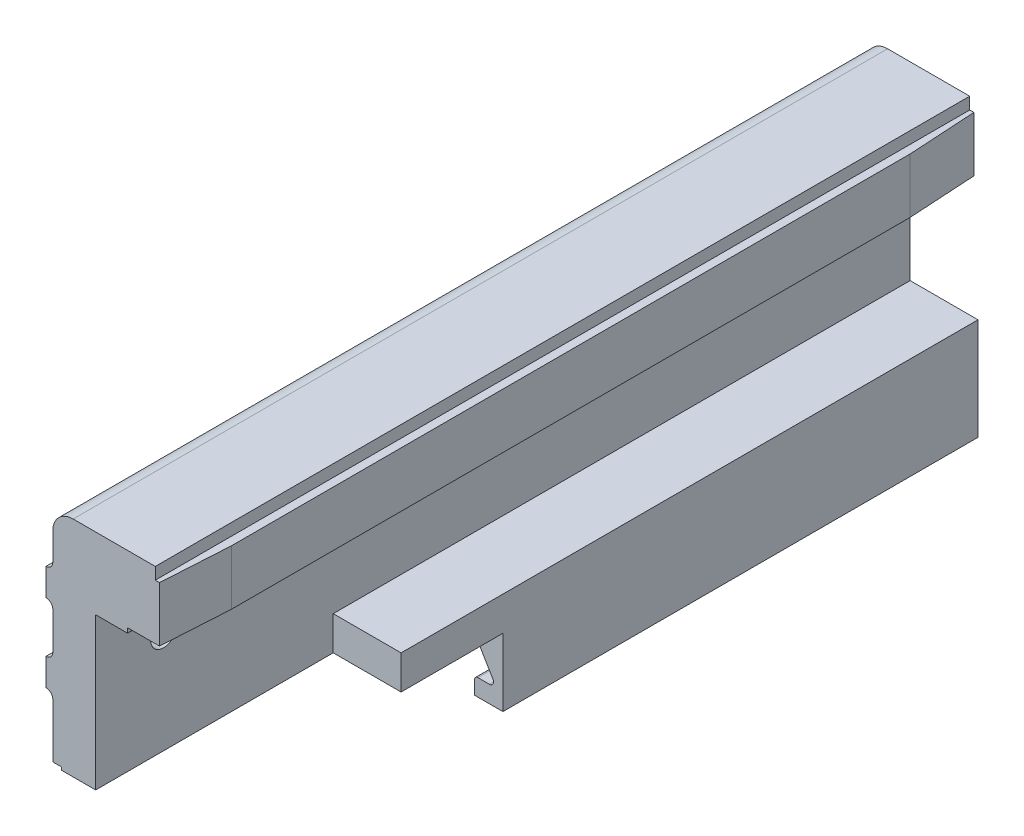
from build123d import *

# Parameters (mm, degrees)
EXTRUDE1_DEPTH     = 152.4
SKETCH2_W          = 63.5
SKETCH2_H          = 12.7
CUT_EXTRUDE1_DEPTH = 164.342499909
SKETCH3_W          = 44.45
SKETCH3_H          = 6.35
CUT_EXTRUDE2_DEPTH = 12.7
SKETCH4_R          = 2.413
CUT_EXTRUDE3_DEPTH = 163.352134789
CUT_EXTRUDE4_REACH = 164.539
SKETCH10_W         = 0.790251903
SKETCH10_H         = 0.684884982
SKETCH10_H_2       = 3.002957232
EXTRUDE3_DEPTH     = 0.127


with BuildPart() as part:
    # Sketch1 → Extrude1 (new body)
    with BuildSketch(Plane.XY):
        with BuildLine():
            Line((19.91614, 54.5084), (4.546619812, 54.5084))
            ThreePointArc((4.546619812, 54.5084), (1.852528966, 53.392471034), (0.7366, 50.698380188))
            Line((0.7366, 50.698380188), (0.7366, 45.567713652))
            ThreePointArc((0.7366, 45.567713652), (0.364632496, 44.669647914), (-0.5334, 44.297600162))
            Line((-0.5334, 44.297600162), (-0.5334, 39.217600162))
            ThreePointArc((-0.5334, 39.217600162), (0.358682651, 38.85157562), (0.7366, 37.964465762))
            Line((0.7366, 37.964465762), (0.7366, 30.988190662))
            ThreePointArc((0.7366, 30.988190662), (0.36459237, 30.090084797), (-0.533513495, 29.718077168))
            Line((-0.533513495, 29.718077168), (-0.533513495, 24.638077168))
            ThreePointArc((-0.533513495, 24.638077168), (0.36459237, 24.266069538), (0.7366, 23.367963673))
            Line((0.7366, 23.367963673), (0.7366, 13.235253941))
            Line((0.7366, 13.235253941), (2.413, 13.235253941))
            Line((2.413, 13.235253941), (2.413, 10.822253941))
            ThreePointArc((2.413, 10.822253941), (2.355993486, 10.533068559), (2.193503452, 10.287152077))
            Line((2.193503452, 10.287152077), (0.219496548, 8.28584049))
            ThreePointArc((0.219496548, 8.28584049), (0.057006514, 8.039924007), (0, 7.750738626))
            Line((0, 7.750738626), (0, 0))
            Line((0, 0), (7.7216, 0))
            Line((7.7216, 0), (7.7216, 2.54))
            ThreePointArc((7.7216, 2.54), (7.535612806, 2.989012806), (7.0866, 3.175))
            Line((7.0866, 3.175), (2.667, 3.175))
            ThreePointArc((2.667, 3.175), (1.964009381, 3.642979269), (2.124496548, 4.472101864))
            Line((2.124496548, 4.472101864), (8.414593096, 10.849203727))
            ThreePointArc((8.414593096, 10.849203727), (8.911558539, 11.184981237), (9.4996, 11.303))
            Line((9.4996, 11.303), (14.5796, 11.303))
            ThreePointArc((14.5796, 11.303), (15.332434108, 11.104072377), (15.88873344, 10.559221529))
            Line((15.88873344, 10.559221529), (19.60296672, 4.327110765))
            ThreePointArc((19.60296672, 4.327110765), (19.610936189, 3.560582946), (18.9484, 3.175))
            Line((18.9484, 3.175), (16.7894, 3.175))
            ThreePointArc((16.7894, 3.175), (16.340387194, 2.989012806), (16.1544, 2.54))
            Line((16.1544, 2.54), (16.1544, 0))
            Line((16.1544, 0), (21.463, 0))
            Line((21.463, 0), (21.463, 19.05))
            Line((21.463, 19.05), (8.763, 19.05))
            Line((8.763, 19.05), (8.763, 41.0972))
            Line((8.763, 41.0972), (14.732, 41.0972))
            Line((14.732, 41.0972), (14.732, 41.9862))
            Line((14.732, 41.9862), (21.463, 41.9862))
            Line((21.463, 41.9862), (21.463, 52.2732))
            Line((21.463, 52.2732), (19.91614, 52.2732))
            Line((19.91614, 52.2732), (19.91614, 54.5084))
        make_face()
    extrude(amount=-EXTRUDE1_DEPTH)

    # Sketch2 → Cut-Extrude1 (cut, through all)
    with BuildSketch(Plane(origin=(21.463, 0, 0), x_dir=(0, 0, -1), z_dir=(1, 0, 0))):
        with Locations((31.75, 6.35)):
            Rectangle(SKETCH2_W, SKETCH2_H)
    extrude(amount=-CUT_EXTRUDE1_DEPTH, mode=Mode.SUBTRACT)

    # Sketch3 → Cut-Extrude2 (cut)
    with BuildSketch(Plane(origin=(21.463, 0, 0), x_dir=(0, 0, -1), z_dir=(1, 0, 0))):
        with Locations((22.225, 15.875)):
            Rectangle(SKETCH3_W, SKETCH3_H)
    extrude(amount=-CUT_EXTRUDE2_DEPTH, mode=Mode.SUBTRACT)

    # Sketch4 → Cut-Extrude3 (cut, through all)
    with BuildSketch(Plane(origin=(8.763, 0, 0), x_dir=(0, 0, -1), z_dir=(1, 0, 0))):
        with Locations((12.7, 31.8008)):
            Circle(SKETCH4_R)
        with Locations((139.7, 31.8008)):
            Circle(SKETCH4_R)
    extrude(amount=-CUT_EXTRUDE3_DEPTH, mode=Mode.SUBTRACT)

    # Sketch6 → Cut-Extrude4 (cut, up to next)
    with BuildSketch(Plane(origin=(0, 52.2732, 0), x_dir=(-1, 0, 0), z_dir=(0, 1, 0)), mode=Mode.PRIVATE) as cut_extrude4_sk1:
        Polygon((-21.463, -152.4), (-21.463, -139.7), (-20.701, -152.4), align=None)
    cut_extrude4_tool1 = extrude(cut_extrude4_sk1.sketch, amount=-CUT_EXTRUDE4_REACH, mode=Mode.PRIVATE) & part.part
    # Sketch6 → Cut-Extrude4 (cut, up to next)
    with BuildSketch(Plane(origin=(0, 52.2732, 0), x_dir=(-1, 0, 0), z_dir=(0, 1, 0)), mode=Mode.PRIVATE) as cut_extrude4_sk2:
        Polygon((-21.463, 0), (-21.463, -12.7), (-20.701, 0), align=None)
    cut_extrude4_tool2 = extrude(cut_extrude4_sk2.sketch, amount=-CUT_EXTRUDE4_REACH, mode=Mode.PRIVATE) & part.part
    add(cut_extrude4_tool1.solids().sort_by_distance((21.209, 52.2732, -148.166667))[0], mode=Mode.SUBTRACT)
    add(cut_extrude4_tool2.solids().sort_by_distance((21.209, 52.2732, -4.233333))[0], mode=Mode.SUBTRACT)

    # Sketch10 → Extrude3 (add)
    # profile 1 of 10: a face of its own
    with BuildSketch(Plane.ZY.offset(-0.7366)):
        with BuildLine():
            add(Edge.make_bspline(
                [(-50.311029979, 33.066190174), (-50.260220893, 33.031363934), (-50.158405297, 32.961576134), (-49.996458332, 32.871296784), (-49.829363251, 32.789223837), (-49.713236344, 32.745079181), (-49.654956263, 32.722924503)],
                knots=[0, 0, 0, 0, 0.994855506, 1.99357661, 2.993045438, 4, 4, 4, 4], degree=3))
            Line((-49.654956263, 32.722924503), (-49.95706298, 32.143406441))
            add(Edge.make_bspline(
                [(-49.95706298, 32.143406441), (-50.018825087, 32.162524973), (-50.143331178, 32.201065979), (-50.260858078, 32.257418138), (-50.320084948, 32.285816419)],
                knots=[0, 0, 0, 0, 0.992113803, 2, 2, 2, 2], degree=3))
            add(Edge.make_bspline(
                [(-50.320084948, 32.285816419), (-50.32589684, 32.288748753), (-50.342727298, 32.297240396), (-50.373297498, 32.318144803), (-50.419940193, 32.346320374), (-50.480656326, 32.385347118), (-50.556056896, 32.433720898), (-50.646385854, 32.491389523), (-50.750397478, 32.559983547), (-50.825198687, 32.60829556), (-50.86502949, 32.634021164)],
                knots=[0, 0, 0, 0, 0.241377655, 0.698997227, 1.371388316, 2.263975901, 3.376788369, 4.695767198, 6.240533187, 8, 8, 8, 8], degree=3))
            add(Edge.make_bspline(
                [(-50.86502949, 32.634021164), (-50.898062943, 32.619874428), (-50.964449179, 32.591444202), (-51.067450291, 32.556436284), (-51.17307066, 32.526945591), (-51.280935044, 32.501935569), (-51.391499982, 32.483352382), (-51.50460917, 32.469101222), (-51.620579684, 32.460743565), (-51.698896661, 32.459921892), (-51.738422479, 32.459507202)],
                knots=[0, 0, 0, 0, 0.961025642, 1.931341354, 2.907359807, 3.893838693, 4.891829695, 5.905170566, 6.942759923, 8, 8, 8, 8], degree=3))
            add(Edge.make_bspline(
                [(-51.738422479, 32.459507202), (-51.813397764, 32.461332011), (-51.95995306, 32.464898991), (-52.173649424, 32.490179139), (-52.374443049, 32.533996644), (-52.563215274, 32.593847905), (-52.738831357, 32.672417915), (-52.902831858, 32.76739109), (-53.052946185, 32.881231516), (-53.191242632, 33.010450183), (-53.313595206, 33.156501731), (-53.420706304, 33.316836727), (-53.511443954, 33.490923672), (-53.584609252, 33.679679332), (-53.642433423, 33.881577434), (-53.681857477, 34.09804325), (-53.707231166, 34.327792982), (-53.710107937, 34.485829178), (-53.711582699, 34.56684561)],
                knots=[0, 0, 0, 0, 1.098101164, 2.146474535, 3.146072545, 4.104420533, 5.041773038, 5.958565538, 6.874115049, 7.795336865, 8.725215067, 9.658214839, 10.614563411, 11.594512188, 12.618591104, 13.685899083, 14.813688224, 16, 16, 16, 16], degree=3))
            add(Edge.make_bspline(
                [(-53.711582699, 34.56684561), (-53.710104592, 34.647858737), (-53.707231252, 34.805342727), (-53.682030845, 35.034649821), (-53.641292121, 35.25034225), (-53.584057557, 35.452561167), (-53.509796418, 35.640775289), (-53.418704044, 35.814879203), (-53.31142455, 35.975552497), (-53.187621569, 36.121282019), (-53.050058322, 36.251823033), (-52.899507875, 36.364817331), (-52.737720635, 36.461292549), (-52.564053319, 36.539788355), (-52.37802651, 36.599606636), (-52.181056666, 36.643284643), (-51.972053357, 36.668873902), (-51.829043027, 36.672384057), (-51.755709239, 36.674184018)],
                knots=[0, 0, 0, 0, 1.193283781, 2.319662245, 3.393996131, 4.424093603, 5.411284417, 6.369670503, 7.313761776, 8.251713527, 9.181123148, 10.102053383, 11.01932051, 11.951118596, 12.903560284, 13.893239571, 14.919681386, 16, 16, 16, 16], degree=3))
            add(Edge.make_bspline(
                [(-51.755709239, 36.674184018), (-51.68290217, 36.67286055), (-51.540898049, 36.670279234), (-51.333836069, 36.642671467), (-51.138180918, 36.600783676), (-50.953699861, 36.540402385), (-50.781338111, 36.461986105), (-50.620198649, 36.366778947), (-50.471221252, 36.253976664), (-50.334363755, 36.124681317), (-50.2119586, 35.979454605), (-50.103524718, 35.820685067), (-50.014498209, 35.646415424), (-49.939498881, 35.459602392), (-49.883590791, 35.258423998), (-49.842319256, 35.044033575), (-49.817468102, 34.815755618), (-49.814518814, 34.658829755), (-49.813006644, 34.578370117)],
                knots=[0, 0, 0, 0, 1.078752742, 2.104017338, 3.091035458, 4.041673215, 4.975566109, 5.892967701, 6.810684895, 7.740128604, 8.678185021, 9.621404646, 10.583875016, 11.573429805, 12.6009998, 13.674031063, 14.80742018, 16, 16, 16, 16], degree=3))
            add(Edge.make_bspline(
                [(-49.813006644, 34.578370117), (-49.814637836, 34.493501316), (-49.817808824, 34.328518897), (-49.84540579, 34.08892719), (-49.890141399, 33.864544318), (-49.936229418, 33.723539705), (-49.958709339, 33.654763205)],
                knots=[0, 0, 0, 0, 1.083667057, 2.106616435, 3.076482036, 4, 4, 4, 4], degree=3))
            add(Edge.make_bspline(
                [(-49.958709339, 33.654763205), (-49.978860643, 33.604103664), (-50.019854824, 33.501045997), (-50.100885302, 33.352288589), (-50.197295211, 33.205527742), (-50.272580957, 33.113294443), (-50.311029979, 33.066190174)],
                knots=[0, 0, 0, 0, 0.948216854, 1.928975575, 2.942311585, 4, 4, 4, 4], degree=3))
        make_face()
        with BuildLine():
            add(Edge.make_bspline(
                [(-50.97039641, 33.489304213), (-50.940684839, 33.521786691), (-50.881190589, 33.586829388), (-50.807620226, 33.698235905), (-50.743387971, 33.817706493), (-50.692887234, 33.948221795), (-50.652271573, 34.087794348), (-50.623925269, 34.237461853), (-50.606320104, 34.396848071), (-50.604297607, 34.506431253), (-50.603258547, 34.562729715)],
                knots=[0, 0, 0, 0, 0.906820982, 1.815812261, 2.745108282, 3.70056618, 4.696560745, 5.740060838, 6.83895416, 8, 8, 8, 8], degree=3))
            add(Edge.make_bspline(
                [(-50.603258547, 34.562729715), (-50.604169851, 34.620655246), (-50.605935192, 34.732866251), (-50.620557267, 34.895812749), (-50.646288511, 35.04727694), (-50.679870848, 35.187890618), (-50.7256262, 35.316515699), (-50.780806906, 35.434121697), (-50.845499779, 35.54099798), (-50.921294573, 35.635381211), (-51.004661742, 35.718357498), (-51.093780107, 35.791658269), (-51.189951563, 35.853015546), (-51.292686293, 35.902373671), (-51.40112458, 35.941211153), (-51.515523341, 35.969406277), (-51.636140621, 35.985905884), (-51.718615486, 35.988153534), (-51.760648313, 35.989299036)],
                knots=[0, 0, 0, 0, 1.335693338, 2.587451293, 3.768164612, 4.876224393, 5.916940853, 6.910477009, 7.867661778, 8.790666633, 9.694493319, 10.576027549, 11.446684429, 12.318352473, 13.199023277, 14.098364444, 15.030842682, 16, 16, 16, 16], degree=3))
            add(Edge.make_bspline(
                [(-51.760648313, 35.989299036), (-51.80296255, 35.988190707), (-51.885725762, 35.986022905), (-52.006461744, 35.969123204), (-52.121121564, 35.942286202), (-52.229424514, 35.90314192), (-52.3323497, 35.85369016), (-52.428880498, 35.792446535), (-52.519003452, 35.720296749), (-52.602790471, 35.637844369), (-52.677624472, 35.543431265), (-52.744145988, 35.438415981), (-52.799138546, 35.321589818), (-52.84329949, 35.193608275), (-52.878591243, 35.05512905), (-52.904005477, 34.905409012), (-52.918646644, 34.744673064), (-52.920418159, 34.633828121), (-52.921330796, 34.576723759)],
                knots=[0, 0, 0, 0, 0.980107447, 1.917010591, 2.819119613, 3.703969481, 4.579773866, 5.459928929, 6.346604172, 7.250235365, 8.177620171, 9.131899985, 10.124404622, 11.161948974, 12.264485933, 13.431998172, 14.677033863, 16, 16, 16, 16], degree=3))
            add(Edge.make_bspline(
                [(-52.921330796, 34.576723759), (-52.92044062, 34.518793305), (-52.918712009, 34.406299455), (-52.903752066, 34.24319346), (-52.87949925, 34.091227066), (-52.844974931, 33.950463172), (-52.80083418, 33.820740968), (-52.746464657, 33.702241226), (-52.682154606, 33.59511213), (-52.607697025, 33.500325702), (-52.525786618, 33.416936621), (-52.43826186, 33.344239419), (-52.345833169, 33.281964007), (-52.248069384, 33.231365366), (-52.144944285, 33.192507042), (-52.036817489, 33.164462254), (-51.923059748, 33.147746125), (-51.845491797, 33.145525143), (-51.805923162, 33.144392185)],
                knots=[0, 0, 0, 0, 1.356840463, 2.634818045, 3.833173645, 4.958776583, 6.025986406, 7.038359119, 8.007356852, 8.946032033, 9.855123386, 10.740685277, 11.607120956, 12.460971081, 13.313368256, 14.183325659, 15.073285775, 16, 16, 16, 16], degree=3))
            add(Edge.make_bspline(
                [(-51.805923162, 33.144392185), (-51.776248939, 33.144912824), (-51.71779689, 33.145938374), (-51.631440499, 33.157466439), (-51.547320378, 33.174131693), (-51.492988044, 33.191100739), (-51.465950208, 33.199545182)],
                knots=[0, 0, 0, 0, 1.028828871, 2.026578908, 3.017950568, 4, 4, 4, 4], degree=3))
            add(Edge.make_bspline(
                [(-51.465950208, 33.199545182), (-51.507402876, 33.221204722), (-51.589489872, 33.264096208), (-51.716400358, 33.31874778), (-51.843564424, 33.367987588), (-51.930051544, 33.394590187), (-51.973028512, 33.407809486)],
                knots=[0, 0, 0, 0, 1.021704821, 2.023239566, 3.017713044, 4, 4, 4, 4], degree=3))
            Line((-51.973028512, 33.407809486), (-51.743361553, 33.881960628))
            add(Edge.make_bspline(
                [(-51.743361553, 33.881960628), (-51.676198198, 33.858750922), (-51.541223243, 33.812107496), (-51.346245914, 33.71948968), (-51.153985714, 33.614077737), (-51.032053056, 33.531208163), (-50.97039641, 33.489304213)],
                knots=[0, 0, 0, 0, 0.979271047, 1.967993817, 2.972492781, 4, 4, 4, 4], degree=3))
        make_face(mode=Mode.SUBTRACT)
    # profile 2 of 10: a face of its own
    with BuildSketch(Plane.ZY.offset(-0.7366)):
        with BuildLine():
            Line((-47.284200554, 32.512190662), (-47.284200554, 32.954237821))
            add(Edge.make_bspline(
                [(-47.284200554, 32.954237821), (-47.310364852, 32.916402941), (-47.362284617, 32.841324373), (-47.457698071, 32.742940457), (-47.564545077, 32.657572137), (-47.68208096, 32.586424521), (-47.806696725, 32.529678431), (-47.936305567, 32.48893492), (-48.069410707, 32.4644596), (-48.159414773, 32.461160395), (-48.20451475, 32.459507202)],
                knots=[0, 0, 0, 0, 1.012300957, 2.008784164, 3.006972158, 4.019128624, 5.028517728, 6.017265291, 7.006475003, 8, 8, 8, 8], degree=3))
            add(Edge.make_bspline(
                [(-48.20451475, 32.459507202), (-48.250179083, 32.461018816), (-48.339733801, 32.46398332), (-48.470220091, 32.489397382), (-48.593393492, 32.530935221), (-48.708641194, 32.588052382), (-48.81211093, 32.661158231), (-48.902188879, 32.747717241), (-48.974983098, 32.849075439), (-49.023333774, 32.943320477), (-49.053675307, 33.026180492), (-49.073073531, 33.094821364), (-49.090659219, 33.169164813), (-49.104152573, 33.249215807), (-49.115099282, 33.334884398), (-49.121977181, 33.426111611), (-49.127318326, 33.52326687), (-49.127848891, 33.589998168), (-49.128121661, 33.62430558)],
                knots=[0, 0, 0, 0, 1.289498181, 2.528902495, 3.740215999, 4.953909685, 6.150063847, 7.307074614, 8.467199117, 9.660131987, 10.288158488, 10.958106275, 11.674712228, 12.445953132, 13.25095176, 14.114470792, 15.030625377, 16, 16, 16, 16], degree=3))
            Line((-49.128121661, 33.62430558), (-49.128121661, 35.515147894))
            Line((-49.128121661, 35.515147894), (-48.337869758, 35.515147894))
            Line((-48.337869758, 35.515147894), (-48.337869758, 34.129737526))
            add(Edge.make_bspline(
                [(-48.337869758, 34.129737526), (-48.337638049, 34.079249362), (-48.337198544, 33.983483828), (-48.335919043, 33.847365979), (-48.332408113, 33.726910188), (-48.328657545, 33.621776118), (-48.323096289, 33.531999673), (-48.315885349, 33.457584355), (-48.307835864, 33.398522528), (-48.296830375, 33.340944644), (-48.274234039, 33.283156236), (-48.243109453, 33.221080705), (-48.200561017, 33.167795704), (-48.151340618, 33.121516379), (-48.093984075, 33.083167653), (-48.027823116, 33.058952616), (-47.955775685, 33.040877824), (-47.905006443, 33.039660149), (-47.87853584, 33.039025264)],
                knots=[0, 0, 0, 0, 1.799930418, 3.414093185, 4.852592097, 6.095879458, 7.164323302, 8.058836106, 8.760219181, 9.289718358, 10.143846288, 10.96209893, 11.756558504, 12.559405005, 13.365225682, 14.195378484, 15.059087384, 16, 16, 16, 16], degree=3))
            add(Edge.make_bspline(
                [(-47.87853584, 33.039025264), (-47.847971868, 33.040548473), (-47.787785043, 33.043547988), (-47.699821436, 33.064451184), (-47.617671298, 33.10075345), (-47.541069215, 33.149042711), (-47.474004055, 33.208829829), (-47.415767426, 33.275235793), (-47.370403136, 33.349031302), (-47.341476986, 33.417808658), (-47.324142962, 33.482948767), (-47.314632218, 33.54760204), (-47.304197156, 33.626544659), (-47.2978165, 33.720855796), (-47.290641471, 33.830012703), (-47.287177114, 33.954383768), (-47.284570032, 34.093779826), (-47.284328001, 34.19174843), (-47.284200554, 34.243336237)],
                knots=[0, 0, 0, 0, 0.960139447, 1.890714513, 2.821289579, 3.770841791, 4.723832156, 5.63466777, 6.536687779, 7.433335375, 7.968708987, 8.650470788, 9.484586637, 10.470508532, 11.619255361, 12.921832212, 14.379114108, 16, 16, 16, 16], degree=3))
            Line((-47.284200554, 34.243336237), (-47.284200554, 35.515147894))
            Line((-47.284200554, 35.515147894), (-46.493948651, 35.515147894))
            Line((-46.493948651, 35.515147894), (-46.493948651, 32.512190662))
            Line((-46.493948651, 32.512190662), (-47.284200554, 32.512190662))
        make_face()
    # profile 3 of 10: a face of its own
    with BuildSketch(Plane.ZY.offset(-0.7366)):
        with Locations((-45.255887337, 36.279058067)):
            Rectangle(SKETCH10_W, SKETCH10_H)
    # profile 4 of 10: a face of its own
    with BuildSketch(Plane.ZY.offset(-0.7366)):
        with Locations((-45.255887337, 34.013669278)):
            Rectangle(SKETCH10_W, SKETCH10_H_2)
    # profile 5 of 10: a face of its own
    with BuildSketch(Plane.ZY.offset(-0.7366)):
        with BuildLine():
            Line((-41.594386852, 34.61952907), (-42.384638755, 34.51416215))
            add(Edge.make_bspline(
                [(-42.384638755, 34.51416215), (-42.39190195, 34.551169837), (-42.40575841, 34.621771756), (-42.440891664, 34.719543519), (-42.488942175, 34.802644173), (-42.549033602, 34.870538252), (-42.619765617, 34.9234458), (-42.700105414, 34.962027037), (-42.790913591, 34.984469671), (-42.85454672, 34.986999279), (-42.887601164, 34.988313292)],
                knots=[0, 0, 0, 0, 1.183520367, 2.2578771, 3.246797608, 4.180863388, 5.085846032, 6.003342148, 6.962829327, 8, 8, 8, 8], degree=3))
            add(Edge.make_bspline(
                [(-42.887601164, 34.988313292), (-42.910132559, 34.987694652), (-42.954051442, 34.986488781), (-43.018293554, 34.976660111), (-43.078473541, 34.958841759), (-43.136129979, 34.936163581), (-43.189367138, 34.905273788), (-43.239762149, 34.868762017), (-43.285736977, 34.82461107), (-43.328836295, 34.774148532), (-43.368464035, 34.715952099), (-43.400576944, 34.647844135), (-43.428734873, 34.571565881), (-43.451619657, 34.486124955), (-43.469263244, 34.391702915), (-43.482542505, 34.288385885), (-43.48963837, 34.17621105), (-43.490529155, 34.098466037), (-43.49099142, 34.058120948)],
                knots=[0, 0, 0, 0, 0.862078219, 1.680389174, 2.478024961, 3.259954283, 4.04533088, 4.826625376, 5.636266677, 6.477958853, 7.363321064, 8.321359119, 9.351280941, 10.472100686, 11.701575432, 13.024867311, 14.456081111, 16, 16, 16, 16], degree=3))
            add(Edge.make_bspline(
                [(-43.49099142, 34.058120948), (-43.490636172, 34.013379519), (-43.489951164, 33.927106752), (-43.481418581, 33.802682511), (-43.46870272, 33.688605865), (-43.450784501, 33.584563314), (-43.42724421, 33.490921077), (-43.398378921, 33.407191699), (-43.36535629, 33.333093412), (-43.324836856, 33.270026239), (-43.281418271, 33.214849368), (-43.232527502, 33.168819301), (-43.182045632, 33.127446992), (-43.125938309, 33.095814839), (-43.067545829, 33.069381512), (-43.004584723, 33.052945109), (-42.938869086, 33.040296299), (-42.893429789, 33.039453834), (-42.870314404, 33.039025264)],
                knots=[0, 0, 0, 0, 1.594318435, 3.074248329, 4.44256617, 5.683784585, 6.834147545, 7.879495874, 8.83778105, 9.716843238, 10.544636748, 11.333080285, 12.105903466, 12.864046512, 13.621684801, 14.38335177, 15.177596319, 16, 16, 16, 16], degree=3))
            add(Edge.make_bspline(
                [(-42.870314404, 33.039025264), (-42.836398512, 33.040483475), (-42.770616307, 33.043311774), (-42.677206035, 33.068652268), (-42.593302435, 33.109688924), (-42.532459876, 33.157936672), (-42.488274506, 33.204401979), (-42.459493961, 33.24720159), (-42.430540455, 33.294029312), (-42.406782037, 33.348216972), (-42.383120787, 33.407176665), (-42.364191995, 33.472776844), (-42.34539073, 33.54335366), (-42.336529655, 33.592943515), (-42.331955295, 33.618543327)],
                knots=[0, 0, 0, 0, 1.391704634, 2.699306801, 3.945045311, 5.206156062, 5.868460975, 6.572467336, 7.320954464, 8.128297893, 8.999513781, 9.930638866, 10.931732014, 12, 12, 12, 12], degree=3))
            Line((-42.331955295, 33.618543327), (-41.541703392, 33.513176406))
            add(Edge.make_bspline(
                [(-41.541703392, 33.513176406), (-41.552106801, 33.471035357), (-41.572495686, 33.388446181), (-41.612123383, 33.269845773), (-41.658379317, 33.158992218), (-41.710726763, 33.055572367), (-41.771121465, 32.960703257), (-41.837887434, 32.873730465), (-41.911757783, 32.795169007), (-41.991782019, 32.72378779), (-42.079208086, 32.661059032), (-42.174170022, 32.607488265), (-42.275280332, 32.561020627), (-42.384205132, 32.524433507), (-42.499590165, 32.494284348), (-42.622530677, 32.474427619), (-42.752328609, 32.461675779), (-42.841196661, 32.460242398), (-42.886777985, 32.459507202)],
                knots=[0, 0, 0, 0, 1.110268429, 2.175934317, 3.195555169, 4.181481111, 5.137790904, 6.068820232, 6.982751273, 7.892872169, 8.808581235, 9.729898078, 10.678730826, 11.651191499, 12.666063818, 13.726769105, 14.834036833, 16, 16, 16, 16], degree=3))
            add(Edge.make_bspline(
                [(-42.886777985, 32.459507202), (-42.93869881, 32.460766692), (-43.039881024, 32.46322116), (-43.187653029, 32.482505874), (-43.327355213, 32.514207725), (-43.459016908, 32.560073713), (-43.583195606, 32.617263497), (-43.698614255, 32.689089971), (-43.805900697, 32.773368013), (-43.904804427, 32.869854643), (-43.99381282, 32.977499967), (-44.070650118, 33.096232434), (-44.135848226, 33.224569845), (-44.189576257, 33.362642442), (-44.230554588, 33.511108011), (-44.259640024, 33.669213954), (-44.278405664, 33.837058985), (-44.280281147, 33.952153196), (-44.281243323, 34.011199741)],
                knots=[0, 0, 0, 0, 1.056003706, 2.057917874, 3.026125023, 3.965316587, 4.889355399, 5.801804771, 6.724223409, 7.659808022, 8.607570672, 9.559810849, 10.530974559, 11.531347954, 12.568834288, 13.659317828, 14.799164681, 16, 16, 16, 16], degree=3))
            add(Edge.make_bspline(
                [(-44.281243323, 34.011199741), (-44.280278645, 34.07079479), (-44.27839788, 34.186983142), (-44.259685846, 34.356197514), (-44.230631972, 34.515431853), (-44.189303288, 34.66446951), (-44.13707385, 34.803580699), (-44.071385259, 34.931892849), (-43.99466825, 35.050682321), (-43.905585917, 35.158261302), (-43.806977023, 35.254834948), (-43.699047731, 35.338433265), (-43.58335237, 35.40986695), (-43.458817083, 35.467458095), (-43.326262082, 35.513231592), (-43.18516643, 35.544817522), (-43.035759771, 35.564117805), (-42.933484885, 35.566572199), (-42.881015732, 35.567831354)],
                knots=[0, 0, 0, 0, 1.206261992, 2.351765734, 3.442553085, 4.480484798, 5.479315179, 6.445885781, 7.393622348, 8.336902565, 9.26806234, 10.182699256, 11.09556262, 12.0152312, 12.955233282, 13.92969179, 14.937888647, 16, 16, 16, 16], degree=3))
            add(Edge.make_bspline(
                [(-42.881015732, 35.567831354), (-42.838177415, 35.567394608), (-42.754529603, 35.566541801), (-42.632531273, 35.554218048), (-42.517145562, 35.536833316), (-42.408460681, 35.511031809), (-42.306428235, 35.478472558), (-42.211222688, 35.438169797), (-42.123231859, 35.389822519), (-42.041340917, 35.334801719), (-41.966031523, 35.271360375), (-41.895749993, 35.201400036), (-41.831280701, 35.123206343), (-41.771865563, 35.037840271), (-41.719480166, 34.943928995), (-41.671328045, 34.843244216), (-41.629540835, 34.734341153), (-41.606278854, 34.658368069), (-41.594386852, 34.61952907)],
                knots=[0, 0, 0, 0, 1.178528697, 2.301242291, 3.371523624, 4.388184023, 5.372173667, 6.316227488, 7.228761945, 8.131556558, 9.02696084, 9.934795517, 10.857276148, 11.812560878, 12.793328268, 13.813516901, 14.882225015, 16, 16, 16, 16], degree=3))
        make_face()
    # profile 6 of 10: a face of its own
    with BuildSketch(Plane.ZY.offset(-0.7366)):
        Polygon((-40.90950187, 32.512190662), (-40.90950187, 36.621500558), (-40.119249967, 36.621500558), (-40.119249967, 34.457362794), (-39.197289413, 35.515147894), (-38.30167059, 35.515147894), (-39.293601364, 34.401386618), (-38.248987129, 32.512190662), (-39.039239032, 32.512190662), (-39.793271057, 33.839978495), (-40.119249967, 33.473663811), (-40.119249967, 32.512190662), align=None)
    # profile 7 of 10: a face of its own
    with BuildSketch(Plane.ZY.offset(-0.7366)):
        with BuildLine():
            Line((-35.114321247, 32.512190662), (-35.90457315, 32.512190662))
            Line((-35.90457315, 32.512190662), (-35.90457315, 32.94600603))
            add(Edge.make_bspline(
                [(-35.90457315, 32.94600603), (-35.933418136, 32.905613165), (-35.989482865, 32.827103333), (-36.08948848, 32.726493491), (-36.194506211, 32.639845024), (-36.308964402, 32.574089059), (-36.425907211, 32.522816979), (-36.544360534, 32.48626554), (-36.663805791, 32.464027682), (-36.743850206, 32.46101041), (-36.783728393, 32.459507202)],
                knots=[0, 0, 0, 0, 1.136300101, 2.208576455, 3.242281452, 4.249058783, 5.223933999, 6.165280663, 7.085941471, 8, 8, 8, 8], degree=3))
            add(Edge.make_bspline(
                [(-36.783728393, 32.459507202), (-36.823308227, 32.460835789), (-36.901553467, 32.463462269), (-37.017001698, 32.482520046), (-37.127805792, 32.516037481), (-37.234499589, 32.561359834), (-37.336691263, 32.619642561), (-37.434275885, 32.691045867), (-37.527447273, 32.775741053), (-37.616108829, 32.872161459), (-37.696487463, 32.9809484), (-37.767778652, 33.099719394), (-37.827100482, 33.22934528), (-37.875494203, 33.36889141), (-37.91327959, 33.518736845), (-37.940307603, 33.678634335), (-37.95567668, 33.84873216), (-37.958023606, 33.965345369), (-37.959228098, 34.025193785)],
                knots=[0, 0, 0, 0, 0.868680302, 1.717291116, 2.559594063, 3.404262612, 4.256691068, 5.136162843, 6.05305749, 7.01654586, 8.006773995, 9.017023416, 10.051895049, 11.130067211, 12.254925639, 13.440213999, 14.686262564, 16, 16, 16, 16], degree=3))
            add(Edge.make_bspline(
                [(-37.959228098, 34.025193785), (-37.958030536, 34.086413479), (-37.955706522, 34.205217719), (-37.940418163, 34.377794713), (-37.913359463, 34.53879985), (-37.87559578, 34.688660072), (-37.827289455, 34.827465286), (-37.767938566, 34.955024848), (-37.697846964, 35.071220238), (-37.616701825, 35.174964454), (-37.527864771, 35.267407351), (-37.432125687, 35.347414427), (-37.330846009, 35.415499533), (-37.224413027, 35.472135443), (-37.111470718, 35.515074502), (-36.99320941, 35.545040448), (-36.869477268, 35.565200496), (-36.784908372, 35.56694235), (-36.74174626, 35.567831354)],
                knots=[0, 0, 0, 0, 1.327136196, 2.575468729, 3.751890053, 4.862767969, 5.921925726, 6.933145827, 7.907387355, 8.856890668, 9.782390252, 10.681851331, 11.556239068, 12.423659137, 13.289752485, 14.16837887, 15.06518071, 16, 16, 16, 16], degree=3))
            add(Edge.make_bspline(
                [(-36.74174626, 35.567831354), (-36.701881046, 35.566548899), (-36.623339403, 35.564022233), (-36.507581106, 35.544406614), (-36.39606004, 35.512605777), (-36.289032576, 35.466304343), (-36.185472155, 35.408652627), (-36.086707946, 35.337292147), (-35.991792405, 35.253470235), (-35.934154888, 35.189762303), (-35.90457315, 35.157065)],
                knots=[0, 0, 0, 0, 0.992399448, 1.955205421, 2.915485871, 3.87381908, 4.85285833, 5.861755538, 6.90257267, 8, 8, 8, 8], degree=3))
            Line((-35.90457315, 35.157065), (-35.90457315, 36.621500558))
            Line((-35.90457315, 36.621500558), (-35.114321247, 36.621500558))
            Line((-35.114321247, 36.621500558), (-35.114321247, 32.512190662))
        make_face()
        with BuildLine():
            add(Edge.make_bspline(
                [(-37.168976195, 34.070468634), (-37.168858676, 34.03066742), (-37.16863237, 33.954022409), (-37.161366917, 33.843413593), (-37.152249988, 33.74140585), (-37.137853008, 33.648100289), (-37.121441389, 33.562801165), (-37.098860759, 33.486546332), (-37.074103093, 33.417997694), (-37.052532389, 33.377149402), (-37.042206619, 33.357595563)],
                knots=[0, 0, 0, 0, 1.306099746, 2.515150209, 3.637201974, 4.666415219, 5.613193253, 6.485405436, 7.274972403, 8, 8, 8, 8], degree=3))
            add(Edge.make_bspline(
                [(-37.042206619, 33.357595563), (-37.026946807, 33.332167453), (-36.997419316, 33.28296447), (-36.943545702, 33.218618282), (-36.887178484, 33.162336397), (-36.824216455, 33.117669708), (-36.757559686, 33.081630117), (-36.685757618, 33.057095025), (-36.609877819, 33.041643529), (-36.557705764, 33.039911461), (-36.531012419, 33.039025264)],
                knots=[0, 0, 0, 0, 1.120960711, 2.169040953, 3.168100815, 4.128109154, 5.080726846, 6.026866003, 6.990464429, 8, 8, 8, 8], degree=3))
            add(Edge.make_bspline(
                [(-36.531012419, 33.039025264), (-36.509575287, 33.039952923), (-36.467261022, 33.041784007), (-36.405075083, 33.052206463), (-36.345788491, 33.071788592), (-36.289054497, 33.098306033), (-36.233901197, 33.131323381), (-36.182094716, 33.173039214), (-36.132576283, 33.221942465), (-36.085602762, 33.27788259), (-36.042627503, 33.341332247), (-36.005574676, 33.412661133), (-35.974429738, 33.491681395), (-35.948203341, 33.577487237), (-35.928461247, 33.67089672), (-35.915111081, 33.771355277), (-35.905390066, 33.879303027), (-35.904851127, 33.953827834), (-35.90457315, 33.992266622)],
                knots=[0, 0, 0, 0, 0.808519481, 1.595918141, 2.367946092, 3.154732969, 3.953063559, 4.785064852, 5.655532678, 6.573390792, 7.534530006, 8.538576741, 9.596996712, 10.732480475, 11.917354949, 13.191565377, 14.551451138, 16, 16, 16, 16], degree=3))
            add(Edge.make_bspline(
                [(-35.90457315, 33.992266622), (-35.904948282, 34.034812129), (-35.905672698, 34.116971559), (-35.913978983, 34.235691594), (-35.927610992, 34.345436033), (-35.947324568, 34.445786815), (-35.971656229, 34.537108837), (-36.002081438, 34.619057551), (-36.037905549, 34.692045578), (-36.080418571, 34.755169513), (-36.127161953, 34.809449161), (-36.17523953, 34.858013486), (-36.228040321, 34.89766793), (-36.283259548, 34.931035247), (-36.342217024, 34.956811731), (-36.404547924, 34.974575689), (-36.469611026, 34.986928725), (-36.514215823, 34.987848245), (-36.536774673, 34.988313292)],
                knots=[0, 0, 0, 0, 1.538844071, 2.971654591, 4.302575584, 5.536777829, 6.668535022, 7.717613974, 8.694219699, 9.60272161, 10.461894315, 11.283130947, 12.06930595, 12.843865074, 13.612870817, 14.388700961, 15.185086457, 16, 16, 16, 16], degree=3))
            add(Edge.make_bspline(
                [(-36.536774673, 34.988313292), (-36.558770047, 34.98775479), (-36.602208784, 34.986651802), (-36.665821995, 34.975669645), (-36.726666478, 34.957467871), (-36.784468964, 34.931541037), (-36.840150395, 34.899288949), (-36.893023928, 34.859611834), (-36.942611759, 34.812022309), (-36.989270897, 34.757816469), (-37.032768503, 34.697050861), (-37.068357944, 34.627828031), (-37.100108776, 34.552607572), (-37.125342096, 34.469813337), (-37.144973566, 34.380048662), (-37.158470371, 34.283162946), (-37.168159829, 34.179323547), (-37.168698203, 34.107536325), (-37.168976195, 34.070468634)],
                knots=[0, 0, 0, 0, 0.844531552, 1.667868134, 2.47173451, 3.278912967, 4.096287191, 4.939765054, 5.812329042, 6.731790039, 7.685377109, 8.6758465, 9.71559549, 10.819442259, 11.996209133, 13.242749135, 14.576279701, 16, 16, 16, 16], degree=3))
        make_face(mode=Mode.SUBTRACT)
    # profile 8 of 10: a face of its own
    with BuildSketch(Plane.ZY.offset(-0.7366)):
        with BuildLine():
            Line((-33.481133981, 32.512190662), (-34.271385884, 32.512190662))
            Line((-34.271385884, 32.512190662), (-34.271385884, 35.515147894))
            Line((-34.271385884, 35.515147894), (-33.481133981, 35.515147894))
            Line((-33.481133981, 35.515147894), (-33.481133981, 35.096149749))
            add(Edge.make_bspline(
                [(-33.481133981, 35.096149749), (-33.467479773, 35.11978514), (-33.441137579, 35.165383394), (-33.402170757, 35.230410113), (-33.363392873, 35.288362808), (-33.325163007, 35.339242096), (-33.289716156, 35.384956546), (-33.253653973, 35.422926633), (-33.219773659, 35.455550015), (-33.174442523, 35.488163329), (-33.116264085, 35.519993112), (-33.043141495, 35.548604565), (-32.964829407, 35.56424224), (-32.911558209, 35.566617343), (-32.884329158, 35.567831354)],
                knots=[0, 0, 0, 0, 1.218987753, 2.351715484, 3.384890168, 4.330893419, 5.1939795, 5.965577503, 6.66790098, 7.29043559, 8.453252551, 9.620708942, 10.783848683, 12, 12, 12, 12], degree=3))
            add(Edge.make_bspline(
                [(-32.884329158, 35.567831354), (-32.844906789, 35.565618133), (-32.765727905, 35.561172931), (-32.648431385, 35.52942158), (-32.534382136, 35.475673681), (-32.463851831, 35.426775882), (-32.427464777, 35.401549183)],
                knots=[0, 0, 0, 0, 0.956058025, 1.920219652, 2.927027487, 4, 4, 4, 4], degree=3))
            Line((-32.427464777, 35.401549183), (-32.611856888, 34.649986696))
            add(Edge.make_bspline(
                [(-32.611856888, 34.649986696), (-32.642937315, 34.669534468), (-32.702151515, 34.706776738), (-32.794577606, 34.746341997), (-32.883475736, 34.772245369), (-32.942342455, 34.775842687), (-32.97076296, 34.777579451)],
                knots=[0, 0, 0, 0, 1.139741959, 2.17142794, 3.117176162, 4, 4, 4, 4], degree=3))
            add(Edge.make_bspline(
                [(-32.97076296, 34.777579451), (-32.996376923, 34.77648527), (-33.046240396, 34.774355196), (-33.118021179, 34.757391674), (-33.184198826, 34.730060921), (-33.245036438, 34.69077239), (-33.299443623, 34.635821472), (-33.346283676, 34.563430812), (-33.385485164, 34.472932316), (-33.415447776, 34.385089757), (-33.434130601, 34.299710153), (-33.447306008, 34.218411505), (-33.457316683, 34.121085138), (-33.466480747, 34.008026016), (-33.472623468, 33.878984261), (-33.477459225, 33.734366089), (-33.480951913, 33.573833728), (-33.481071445, 33.461592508), (-33.481133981, 33.402870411)],
                knots=[0, 0, 0, 0, 0.752818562, 1.4655346, 2.15662141, 2.850671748, 3.581264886, 4.414089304, 5.371394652, 6.476667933, 7.138571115, 7.940099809, 8.898357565, 10.015825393, 11.276710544, 12.698206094, 14.272575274, 16, 16, 16, 16], degree=3))
            Line((-33.481133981, 33.402870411), (-33.481133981, 32.512190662))
        make_face()
    # profile 9 of 10: a face of its own
    with BuildSketch(Plane.ZY.offset(-0.7366)):
        with BuildLine():
            Line((-31.531845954, 34.61952907), (-32.216730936, 34.724895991))
            add(Edge.make_bspline(
                [(-32.216730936, 34.724895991), (-32.206466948, 34.759609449), (-32.186375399, 34.827560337), (-32.149507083, 34.924934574), (-32.10633466, 35.014956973), (-32.058721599, 35.098702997), (-32.005200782, 35.17525714), (-31.946627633, 35.244818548), (-31.882671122, 35.307149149), (-31.813025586, 35.36273149), (-31.736351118, 35.412107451), (-31.650907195, 35.45396844), (-31.556821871, 35.489215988), (-31.454227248, 35.517542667), (-31.343295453, 35.541224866), (-31.223177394, 35.55572275), (-31.094647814, 35.566187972), (-31.00613283, 35.56727281), (-30.960559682, 35.567831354)],
                knots=[0, 0, 0, 0, 1.047140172, 2.049755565, 3.008539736, 3.933190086, 4.833981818, 5.707167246, 6.560530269, 7.413560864, 8.281243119, 9.193714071, 10.161006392, 11.183910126, 12.270717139, 13.439589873, 14.681737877, 16, 16, 16, 16], degree=3))
            add(Edge.make_bspline(
                [(-30.960559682, 35.567831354), (-30.919118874, 35.567601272), (-30.838937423, 35.5671561), (-30.722778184, 35.561319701), (-30.614800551, 35.551749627), (-30.5151458, 35.537603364), (-30.423485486, 35.520781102), (-30.340112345, 35.499448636), (-30.264778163, 35.47427395), (-30.177734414, 35.435140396), (-30.082121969, 35.380147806), (-29.982329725, 35.305477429), (-29.902266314, 35.220536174), (-29.849279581, 35.141259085), (-29.817987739, 35.069403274), (-29.795907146, 35.006094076), (-29.78004209, 34.932123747), (-29.764427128, 34.848551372), (-29.754844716, 34.754924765), (-29.746196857, 34.651220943), (-29.741513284, 34.537527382), (-29.740917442, 34.458189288), (-29.740608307, 34.41702702)],
                knots=[0, 0, 0, 0, 1.253259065, 2.424859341, 3.516580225, 4.530621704, 5.468151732, 6.333678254, 7.13150538, 7.867126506, 9.216626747, 10.459871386, 11.622324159, 12.731817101, 13.322505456, 13.989117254, 14.756090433, 15.607496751, 16.559714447, 17.600403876, 18.755039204, 20, 20, 20, 20], degree=3))
            Line((-29.740608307, 34.41702702), (-29.740608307, 33.494243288))
            add(Edge.make_bspline(
                [(-29.740608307, 33.494243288), (-29.740352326, 33.462414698), (-29.739857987, 33.400948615), (-29.738844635, 33.311994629), (-29.734256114, 33.229696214), (-29.72943526, 33.153951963), (-29.723881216, 33.084466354), (-29.716673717, 33.021560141), (-29.707654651, 32.964960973), (-29.693184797, 32.897364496), (-29.669909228, 32.815351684), (-29.631853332, 32.717046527), (-29.586202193, 32.614652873), (-29.549041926, 32.547056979), (-29.529874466, 32.512190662)],
                knots=[0, 0, 0, 0, 1.124218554, 2.171045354, 3.141373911, 4.034856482, 4.851737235, 5.603038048, 6.270604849, 6.87504238, 8.043824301, 9.276776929, 10.59534724, 12, 12, 12, 12], degree=3))
            Line((-29.529874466, 32.512190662), (-30.320126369, 32.512190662))
            add(Edge.make_bspline(
                [(-30.320126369, 32.512190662), (-30.325766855, 32.528056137), (-30.338126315, 32.562820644), (-30.354817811, 32.621095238), (-30.374821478, 32.688992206), (-30.388010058, 32.737984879), (-30.395035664, 32.764083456)],
                knots=[0, 0, 0, 0, 0.768508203, 1.683958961, 2.766236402, 4, 4, 4, 4], degree=3))
            add(Edge.make_bspline(
                [(-30.395035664, 32.764083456), (-30.398064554, 32.775605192), (-30.403547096, 32.796460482), (-30.410853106, 32.82482584), (-30.417187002, 32.846512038), (-30.421348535, 32.858758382), (-30.423023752, 32.863688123)],
                knots=[0, 0, 0, 0, 1.381357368, 2.500370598, 3.396327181, 4, 4, 4, 4], degree=3))
            add(Edge.make_bspline(
                [(-30.423023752, 32.863688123), (-30.456454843, 32.831456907), (-30.521873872, 32.768385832), (-30.628566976, 32.686702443), (-30.737569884, 32.61638332), (-30.850653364, 32.558994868), (-30.966967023, 32.514143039), (-31.087662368, 32.482866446), (-31.212094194, 32.463405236), (-31.296620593, 32.460813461), (-31.339222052, 32.459507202)],
                knots=[0, 0, 0, 0, 1.082260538, 2.117802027, 3.127898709, 4.103827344, 5.070056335, 6.029309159, 7.006768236, 8, 8, 8, 8], degree=3))
            add(Edge.make_bspline(
                [(-31.339222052, 32.459507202), (-31.376288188, 32.46036516), (-31.448683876, 32.462040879), (-31.554324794, 32.473110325), (-31.653625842, 32.494104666), (-31.747041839, 32.522026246), (-31.834799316, 32.557129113), (-31.916140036, 32.601232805), (-31.991541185, 32.653348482), (-32.060254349, 32.713285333), (-32.121839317, 32.779069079), (-32.175887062, 32.849062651), (-32.220598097, 32.924204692), (-32.257587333, 33.003046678), (-32.286853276, 33.08627885), (-32.307040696, 33.173522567), (-32.319908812, 33.265017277), (-32.321357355, 33.327367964), (-32.322097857, 33.359241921)],
                knots=[0, 0, 0, 0, 1.186431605, 2.317277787, 3.39378889, 4.430144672, 5.434756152, 6.413230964, 7.385260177, 8.362630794, 9.325691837, 10.265445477, 11.187216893, 12.118354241, 13.048828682, 14.005299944, 14.980300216, 16, 16, 16, 16], degree=3))
            add(Edge.make_bspline(
                [(-32.322097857, 33.359241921), (-32.320752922, 33.401057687), (-32.318113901, 33.483108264), (-32.295057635, 33.602311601), (-32.258952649, 33.714910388), (-32.207636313, 33.819492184), (-32.143783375, 33.915120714), (-32.066967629, 33.999529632), (-31.978296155, 34.071400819), (-31.875832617, 34.132435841), (-31.755659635, 34.183850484), (-31.615313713, 34.233380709), (-31.451377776, 34.277771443), (-31.333861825, 34.303169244), (-31.271721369, 34.316599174)],
                knots=[0, 0, 0, 0, 0.9565892, 1.877012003, 2.769038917, 3.656897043, 4.535078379, 5.39337207, 6.259743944, 7.138913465, 8.11486349, 9.247429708, 10.544487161, 12, 12, 12, 12], degree=3))
            add(Edge.make_bspline(
                [(-31.271721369, 34.316599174), (-31.228902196, 34.32531224), (-31.146476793, 34.342084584), (-31.028076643, 34.36730244), (-30.91990881, 34.392720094), (-30.822432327, 34.418541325), (-30.734616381, 34.442001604), (-30.657377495, 34.465642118), (-30.590410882, 34.489435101), (-30.549732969, 34.50632567), (-30.53086021, 34.51416215)],
                knots=[0, 0, 0, 0, 1.365613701, 2.628758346, 3.783158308, 4.837685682, 5.780080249, 6.623655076, 7.36143661, 8, 8, 8, 8], degree=3))
            Line((-30.53086021, 34.51416215), (-30.53086021, 34.589071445))
            add(Edge.make_bspline(
                [(-30.53086021, 34.589071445), (-30.531913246, 34.622654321), (-30.533868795, 34.68501963), (-30.553310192, 34.771498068), (-30.587058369, 34.842726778), (-30.627794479, 34.89020027), (-30.668098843, 34.918838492), (-30.703687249, 34.937898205), (-30.745390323, 34.953109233), (-30.792622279, 34.966591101), (-30.846194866, 34.975803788), (-30.905489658, 34.983453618), (-30.970665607, 34.987207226), (-31.015983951, 34.987934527), (-31.039584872, 34.988313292)],
                knots=[0, 0, 0, 0, 1.600506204, 2.972230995, 4.195852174, 5.327580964, 5.908906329, 6.547275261, 7.247479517, 8.022494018, 8.887774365, 9.837646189, 10.873887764, 12, 12, 12, 12], degree=3))
            add(Edge.make_bspline(
                [(-31.039584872, 34.988313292), (-31.070945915, 34.98756392), (-31.130540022, 34.98613992), (-31.214522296, 34.970207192), (-31.288419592, 34.945231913), (-31.352472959, 34.907944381), (-31.407691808, 34.857289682), (-31.455774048, 34.791968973), (-31.498369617, 34.711697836), (-31.520267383, 34.651407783), (-31.531845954, 34.61952907)],
                knots=[0, 0, 0, 0, 1.120680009, 2.129582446, 3.045508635, 3.899130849, 4.760899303, 5.707254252, 6.787697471, 8, 8, 8, 8], degree=3))
        make_face()
        with BuildLine():
            add(Edge.make_bspline(
                [(-30.53086021, 33.934644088), (-30.557982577, 33.92626845), (-30.619069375, 33.907404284), (-30.721677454, 33.879688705), (-30.845356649, 33.850482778), (-30.959409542, 33.825211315), (-31.054619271, 33.80468594), (-31.121783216, 33.787903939), (-31.182306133, 33.771901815), (-31.236278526, 33.75509709), (-31.283772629, 33.739278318), (-31.324097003, 33.722328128), (-31.358655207, 33.70748577), (-31.378038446, 33.695060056), (-31.386966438, 33.689336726)],
                knots=[0, 0, 0, 0, 1.144223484, 2.577096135, 4.283377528, 6.266557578, 7.286341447, 8.209198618, 9.057088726, 9.80932547, 10.487940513, 11.073343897, 11.57317876, 12, 12, 12, 12], degree=3))
            add(Edge.make_bspline(
                [(-31.386966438, 33.689336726), (-31.409068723, 33.671928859), (-31.451485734, 33.638521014), (-31.497725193, 33.573961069), (-31.527067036, 33.502386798), (-31.530233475, 33.45172067), (-31.531845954, 33.425919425)],
                knots=[0, 0, 0, 0, 1.075028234, 2.063111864, 3.013658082, 4, 4, 4, 4], degree=3))
            add(Edge.make_bspline(
                [(-31.531845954, 33.425919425), (-31.530423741, 33.400247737), (-31.527633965, 33.34989078), (-31.505413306, 33.277328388), (-31.468047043, 33.210850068), (-31.417154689, 33.151751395), (-31.355915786, 33.100587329), (-31.2837292, 33.065519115), (-31.204201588, 33.042875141), (-31.148409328, 33.040341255), (-31.119433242, 33.039025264)],
                knots=[0, 0, 0, 0, 0.976809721, 1.916086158, 2.861451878, 3.862738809, 4.873423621, 5.878632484, 6.898253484, 8, 8, 8, 8], degree=3))
            add(Edge.make_bspline(
                [(-31.119433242, 33.039025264), (-31.086323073, 33.040523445), (-31.019666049, 33.043539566), (-30.921904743, 33.071097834), (-30.825383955, 33.111773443), (-30.766777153, 33.15180515), (-30.736654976, 33.172380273)],
                knots=[0, 0, 0, 0, 0.962503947, 1.937702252, 2.940039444, 4, 4, 4, 4], degree=3))
            add(Edge.make_bspline(
                [(-30.736654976, 33.172380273), (-30.715381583, 33.189506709), (-30.674018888, 33.22280631), (-30.624720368, 33.283658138), (-30.58403816, 33.348389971), (-30.567824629, 33.39614369), (-30.559671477, 33.420157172)],
                knots=[0, 0, 0, 0, 1.055399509, 2.052054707, 3.020454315, 4, 4, 4, 4], degree=3))
            add(Edge.make_bspline(
                [(-30.559671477, 33.420157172), (-30.555177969, 33.43984985), (-30.544659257, 33.485947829), (-30.537238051, 33.567101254), (-30.531234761, 33.669207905), (-30.530992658, 33.744473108), (-30.53086021, 33.785648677)],
                knots=[0, 0, 0, 0, 0.659054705, 1.542760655, 2.655710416, 4, 4, 4, 4], degree=3))
            Line((-30.53086021, 33.785648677), (-30.53086021, 33.934644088))
        make_face(mode=Mode.SUBTRACT)
    # profile 10 of 10: a face of its own
    with BuildSketch(Plane.ZY.offset(-0.7366)):
        Polygon((-28.362606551, 32.512190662), (-29.319140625, 35.515147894), (-28.542059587, 35.515147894), (-27.97571239, 33.546926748), (-27.458755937, 35.515147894), (-26.68908351, 35.515147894), (-26.184474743, 33.546926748), (-25.616481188, 35.515147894), (-24.841046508, 35.515147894), (-25.795111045, 32.512190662), (-26.558198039, 32.512190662), (-27.080093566, 34.44336875), (-27.588818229, 32.512190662), align=None)
    extrude(amount=EXTRUDE3_DEPTH)


solid = part.part
